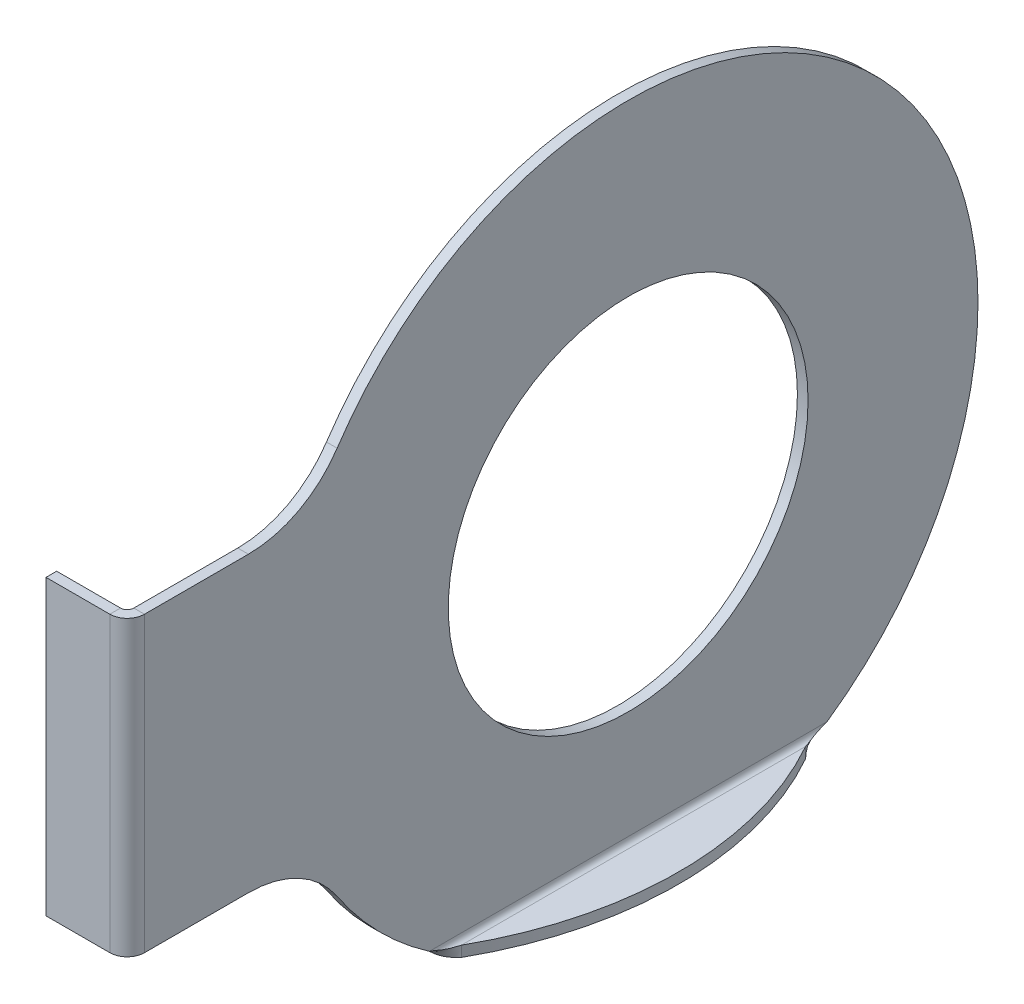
ISO-10303-21;
HEADER;
FILE_DESCRIPTION(('STEP AP214'),'2;1');
FILE_NAME('part.step','',(''),(''),'','','');
FILE_SCHEMA(('AUTOMOTIVE_DESIGN { 1 0 10303 214 1 1 1 1 }'));
ENDSEC;
DATA;
#1=APPLICATION_CONTEXT('core data for automotive mechanical design processes');
#2=APPLICATION_PROTOCOL_DEFINITION('international standard','automotive_design',2000,#1);
#3=PRODUCT_CONTEXT('',#1,'mechanical');
#4=PRODUCT('Part','Part','',(#3));
#5=PRODUCT_RELATED_PRODUCT_CATEGORY('part','',(#4));
#6=PRODUCT_DEFINITION_FORMATION('','',#4);
#7=PRODUCT_DEFINITION_CONTEXT('part definition',#1,'design');
#8=PRODUCT_DEFINITION('design','',#6,#7);
#9=PRODUCT_DEFINITION_SHAPE('','',#8);
#10=(LENGTH_UNIT() NAMED_UNIT(*) SI_UNIT(.MILLI.,.METRE.));
#11=(NAMED_UNIT(*) PLANE_ANGLE_UNIT() SI_UNIT($,.RADIAN.));
#12=(NAMED_UNIT(*) SI_UNIT($,.STERADIAN.) SOLID_ANGLE_UNIT());
#13=UNCERTAINTY_MEASURE_WITH_UNIT(LENGTH_MEASURE(1.E-05),#10,'distance_accuracy_value','');
#14=(GEOMETRIC_REPRESENTATION_CONTEXT(3) GLOBAL_UNCERTAINTY_ASSIGNED_CONTEXT((#13)) GLOBAL_UNIT_ASSIGNED_CONTEXT((#10,
#11,#12)) REPRESENTATION_CONTEXT('',''));
#15=CARTESIAN_POINT('',(0.,0.,0.));
#16=DIRECTION('',(0.,0.,1.));
#17=DIRECTION('',(1.,0.,0.));
#18=AXIS2_PLACEMENT_3D('',#15,#16,#17);
#19=CARTESIAN_POINT('',(0.,38.,56.9934206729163));
#20=DIRECTION('',(-1.,0.,0.));
#21=DIRECTION('',(0.,0.,1.));
#22=AXIS2_PLACEMENT_3D('',#19,#20,#21);
#23=PLANE('',#22);
#24=CARTESIAN_POINT('',(0.,0.,0.));
#25=DIRECTION('',(1.,0.,0.));
#26=DIRECTION('',(0.,0.,-1.));
#27=AXIS2_PLACEMENT_3D('',#24,#25,#26);
#28=CIRCLE('',#27,27.);
#29=CARTESIAN_POINT('',(0.,0.,-27.));
#30=VERTEX_POINT('',#29);
#31=EDGE_CURVE('E330',#30,#30,#28,.T.);
#32=ORIENTED_EDGE('',*,*,#31,.T.);
#33=EDGE_LOOP('',(#32));
#34=FACE_BOUND('',#33,.T.);
#35=DIRECTION('',(0.,0.,-1.));
#36=VECTOR('',#35,1.);
#37=CARTESIAN_POINT('',(0.,-22.,56.9934206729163));
#38=LINE('',#37,#36);
#39=CARTESIAN_POINT('',(0.,-22.,72.590498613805));
#40=VERTEX_POINT('',#39);
#41=CARTESIAN_POINT('',(0.,-22.,56.9934206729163));
#42=VERTEX_POINT('',#41);
#43=EDGE_CURVE('E80',#40,#42,#38,.T.);
#44=ORIENTED_EDGE('',*,*,#43,.F.);
#45=DIRECTION('',(0.,1.,0.));
#46=VECTOR('',#45,1.);
#47=CARTESIAN_POINT('',(0.,38.,72.590498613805));
#48=LINE('',#47,#46);
#49=CARTESIAN_POINT('',(0.,22.,72.590498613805));
#50=VERTEX_POINT('',#49);
#51=EDGE_CURVE('E72',#40,#50,#48,.T.);
#52=ORIENTED_EDGE('',*,*,#51,.T.);
#53=DIRECTION('',(0.,0.,1.));
#54=VECTOR('',#53,1.);
#55=CARTESIAN_POINT('',(0.,22.,56.9934206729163));
#56=LINE('',#55,#54);
#57=CARTESIAN_POINT('',(0.,22.,56.9934206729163));
#58=VERTEX_POINT('',#57);
#59=EDGE_CURVE('E88',#58,#50,#56,.T.);
#60=ORIENTED_EDGE('',*,*,#59,.F.);
#61=CARTESIAN_POINT('',(0.,38.,56.9934206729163));
#62=DIRECTION('',(-1.,0.,0.));
#63=DIRECTION('',(0.,0.,1.));
#64=AXIS2_PLACEMENT_3D('',#61,#62,#63);
#65=CIRCLE('',#64,16.);
#66=CARTESIAN_POINT('',(0.,29.1240875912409,43.6810888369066));
#67=VERTEX_POINT('',#66);
#68=EDGE_CURVE('E329',#67,#58,#65,.T.);
#69=ORIENTED_EDGE('',*,*,#68,.F.);
#70=CARTESIAN_POINT('',(0.,0.,0.));
#71=DIRECTION('',(1.,0.,0.));
#72=DIRECTION('',(0.,0.,-1.));
#73=AXIS2_PLACEMENT_3D('',#70,#71,#72);
#74=CIRCLE('',#73,52.5);
#75=CARTESIAN_POINT('',(0.,-43.1949484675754,-29.8403489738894));
#76=VERTEX_POINT('',#75);
#77=EDGE_CURVE('E345',#76,#67,#74,.T.);
#78=ORIENTED_EDGE('',*,*,#77,.F.);
#79=DIRECTION('',(0.,0.,1.));
#80=VECTOR('',#79,1.);
#81=CARTESIAN_POINT('',(0.,-43.1949484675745,56.9934206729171));
#82=LINE('',#81,#80);
#83=CARTESIAN_POINT('',(0.,-43.1949484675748,29.8403489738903));
#84=VERTEX_POINT('',#83);
#85=EDGE_CURVE('E400',#76,#84,#82,.T.);
#86=ORIENTED_EDGE('',*,*,#85,.T.);
#87=CARTESIAN_POINT('',(0.,-29.1240875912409,43.6810888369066));
#88=VERTEX_POINT('',#87);
#89=EDGE_CURVE('E337',#88,#84,#74,.T.);
#90=ORIENTED_EDGE('',*,*,#89,.F.);
#91=CARTESIAN_POINT('',(0.,-38.,56.9934206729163));
#92=DIRECTION('',(-1.,0.,0.));
#93=DIRECTION('',(0.,0.,-1.));
#94=AXIS2_PLACEMENT_3D('',#91,#92,#93);
#95=CIRCLE('',#94,16.);
#96=EDGE_CURVE('E343',#42,#88,#95,.T.);
#97=ORIENTED_EDGE('',*,*,#96,.F.);
#98=EDGE_LOOP('',(#44,#52,#60,#69,#78,#86,#90,#97));
#99=FACE_BOUND('',#98,.T.);
#100=ADVANCED_FACE('F63',(#34,#99),#23,.T.);
#101=CARTESIAN_POINT('',(1.6,0.,0.));
#102=DIRECTION('',(-1.,0.,0.));
#103=DIRECTION('',(0.,0.,1.));
#104=AXIS2_PLACEMENT_3D('',#101,#102,#103);
#105=CYLINDRICAL_SURFACE('',#104,52.5);
#106=CARTESIAN_POINT('',(1.6,-43.1949484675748,29.8403489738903));
#107=CARTESIAN_POINT('',(0.,-43.1949484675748,29.8403489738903));
#108=B_SPLINE_CURVE_WITH_KNOTS('',1,(#106,#107),.UNSPECIFIED.,.F.,.F.,(2,2),(0.,1.),.UNSPECIFIED.);
#109=CARTESIAN_POINT('',(1.6,-43.1949484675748,29.8403489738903));
#110=VERTEX_POINT('',#109);
#111=EDGE_CURVE('E317',#110,#84,#108,.T.);
#112=ORIENTED_EDGE('',*,*,#111,.F.);
#113=CARTESIAN_POINT('',(1.6,0.,0.));
#114=DIRECTION('',(1.,0.,0.));
#115=DIRECTION('',(0.,0.,-1.));
#116=AXIS2_PLACEMENT_3D('',#113,#114,#115);
#117=CIRCLE('',#116,52.5);
#118=CARTESIAN_POINT('',(1.6,-29.1240875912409,43.6810888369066));
#119=VERTEX_POINT('',#118);
#120=EDGE_CURVE('E350',#119,#110,#117,.T.);
#121=ORIENTED_EDGE('',*,*,#120,.F.);
#122=DIRECTION('',(-1.,0.,0.));
#123=VECTOR('',#122,1.);
#124=CARTESIAN_POINT('',(1.6,-29.1240875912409,43.6810888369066));
#125=LINE('',#124,#123);
#126=EDGE_CURVE('E349',#119,#88,#125,.T.);
#127=ORIENTED_EDGE('',*,*,#126,.T.);
#128=ORIENTED_EDGE('',*,*,#89,.T.);
#129=EDGE_LOOP('',(#112,#121,#127,#128));
#130=FACE_BOUND('',#129,.T.);
#131=ADVANCED_FACE('F388',(#130),#105,.T.);
#132=CARTESIAN_POINT('',(1.6,38.,56.9934206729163));
#133=DIRECTION('',(-1.,0.,0.));
#134=DIRECTION('',(0.,0.,1.));
#135=AXIS2_PLACEMENT_3D('',#132,#133,#134);
#136=PLANE('',#135);
#137=DIRECTION('',(0.,1.,0.));
#138=VECTOR('',#137,1.);
#139=CARTESIAN_POINT('',(1.6,38.,72.590498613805));
#140=LINE('',#139,#138);
#141=CARTESIAN_POINT('',(1.6,-22.,72.590498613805));
#142=VERTEX_POINT('',#141);
#143=CARTESIAN_POINT('',(1.6,22.,72.590498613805));
#144=VERTEX_POINT('',#143);
#145=EDGE_CURVE('E411',#142,#144,#140,.T.);
#146=ORIENTED_EDGE('',*,*,#145,.F.);
#147=DIRECTION('',(0.,0.,-1.));
#148=VECTOR('',#147,1.);
#149=CARTESIAN_POINT('',(1.6,-22.,56.9934206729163));
#150=LINE('',#149,#148);
#151=CARTESIAN_POINT('',(1.6,-22.,56.9934206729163));
#152=VERTEX_POINT('',#151);
#153=EDGE_CURVE('E67',#142,#152,#150,.T.);
#154=ORIENTED_EDGE('',*,*,#153,.T.);
#155=CARTESIAN_POINT('',(1.6,-38.,56.9934206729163));
#156=DIRECTION('',(-1.,0.,0.));
#157=DIRECTION('',(0.,0.,-1.));
#158=AXIS2_PLACEMENT_3D('',#155,#156,#157);
#159=CIRCLE('',#158,16.);
#160=EDGE_CURVE('E338',#152,#119,#159,.T.);
#161=ORIENTED_EDGE('',*,*,#160,.T.);
#162=ORIENTED_EDGE('',*,*,#120,.T.);
#163=DIRECTION('',(0.,0.,1.));
#164=VECTOR('',#163,1.);
#165=CARTESIAN_POINT('',(1.6,-43.1949484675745,56.9934206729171));
#166=LINE('',#165,#164);
#167=CARTESIAN_POINT('',(1.6,-43.1949484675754,-29.8403489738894));
#168=VERTEX_POINT('',#167);
#169=EDGE_CURVE('E358',#168,#110,#166,.T.);
#170=ORIENTED_EDGE('',*,*,#169,.F.);
#171=CARTESIAN_POINT('',(1.6,29.1240875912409,43.6810888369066));
#172=VERTEX_POINT('',#171);
#173=EDGE_CURVE('E340',#168,#172,#117,.T.);
#174=ORIENTED_EDGE('',*,*,#173,.T.);
#175=CARTESIAN_POINT('',(1.6,38.,56.9934206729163));
#176=DIRECTION('',(-1.,0.,0.));
#177=DIRECTION('',(0.,0.,1.));
#178=AXIS2_PLACEMENT_3D('',#175,#176,#177);
#179=CIRCLE('',#178,16.);
#180=CARTESIAN_POINT('',(1.6,22.,56.9934206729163));
#181=VERTEX_POINT('',#180);
#182=EDGE_CURVE('E333',#172,#181,#179,.T.);
#183=ORIENTED_EDGE('',*,*,#182,.T.);
#184=DIRECTION('',(0.,0.,1.));
#185=VECTOR('',#184,1.);
#186=CARTESIAN_POINT('',(1.6,22.,56.9934206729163));
#187=LINE('',#186,#185);
#188=EDGE_CURVE('E336',#181,#144,#187,.T.);
#189=ORIENTED_EDGE('',*,*,#188,.T.);
#190=EDGE_LOOP('',(#146,#154,#161,#162,#170,#174,#183,#189));
#191=FACE_BOUND('',#190,.T.);
#192=CARTESIAN_POINT('',(1.6,0.,0.));
#193=DIRECTION('',(1.,0.,0.));
#194=DIRECTION('',(0.,0.,-1.));
#195=AXIS2_PLACEMENT_3D('',#192,#193,#194);
#196=CIRCLE('',#195,27.);
#197=CARTESIAN_POINT('',(1.6,0.,-27.));
#198=VERTEX_POINT('',#197);
#199=EDGE_CURVE('E321',#198,#198,#196,.T.);
#200=ORIENTED_EDGE('',*,*,#199,.F.);
#201=EDGE_LOOP('',(#200));
#202=FACE_BOUND('',#201,.T.);
#203=ADVANCED_FACE('F390',(#191,#202),#136,.F.);
#204=CARTESIAN_POINT('',(1.6,38.,56.9934206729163));
#205=DIRECTION('',(-1.,0.,0.));
#206=DIRECTION('',(0.,0.,1.));
#207=AXIS2_PLACEMENT_3D('',#204,#205,#206);
#208=CYLINDRICAL_SURFACE('',#207,16.);
#209=ORIENTED_EDGE('',*,*,#68,.T.);
#210=DIRECTION('',(-1.,0.,0.));
#211=VECTOR('',#210,1.);
#212=CARTESIAN_POINT('',(1.6,22.,56.9934206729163));
#213=LINE('',#212,#211);
#214=EDGE_CURVE('E356',#181,#58,#213,.T.);
#215=ORIENTED_EDGE('',*,*,#214,.F.);
#216=ORIENTED_EDGE('',*,*,#182,.F.);
#217=DIRECTION('',(-1.,0.,0.));
#218=VECTOR('',#217,1.);
#219=CARTESIAN_POINT('',(1.6,29.1240875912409,43.6810888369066));
#220=LINE('',#219,#218);
#221=EDGE_CURVE('E346',#172,#67,#220,.T.);
#222=ORIENTED_EDGE('',*,*,#221,.T.);
#223=EDGE_LOOP('',(#209,#215,#216,#222));
#224=FACE_BOUND('',#223,.T.);
#225=ADVANCED_FACE('F389',(#224),#208,.F.);
#226=CARTESIAN_POINT('',(1.6,22.,56.9934206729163));
#227=DIRECTION('',(0.,-1.,0.));
#228=DIRECTION('',(0.,0.,-1.));
#229=AXIS2_PLACEMENT_3D('',#226,#227,#228);
#230=PLANE('',#229);
#231=DIRECTION('',(-1.,0.,0.));
#232=VECTOR('',#231,1.);
#233=CARTESIAN_POINT('',(1.6,22.,72.590498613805));
#234=LINE('',#233,#232);
#235=EDGE_CURVE('E431',#144,#50,#234,.T.);
#236=ORIENTED_EDGE('',*,*,#235,.F.);
#237=ORIENTED_EDGE('',*,*,#188,.F.);
#238=ORIENTED_EDGE('',*,*,#214,.T.);
#239=ORIENTED_EDGE('',*,*,#59,.T.);
#240=EDGE_LOOP('',(#236,#237,#238,#239));
#241=FACE_BOUND('',#240,.T.);
#242=ADVANCED_FACE('F543',(#241),#230,.F.);
#243=CARTESIAN_POINT('',(1.6,-22.,56.9934206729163));
#244=DIRECTION('',(0.,1.,0.));
#245=DIRECTION('',(0.,0.,1.));
#246=AXIS2_PLACEMENT_3D('',#243,#244,#245);
#247=PLANE('',#246);
#248=DIRECTION('',(1.,0.,0.));
#249=VECTOR('',#248,1.);
#250=CARTESIAN_POINT('',(1.6,-22.,72.590498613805));
#251=LINE('',#250,#249);
#252=EDGE_CURVE('E12',#40,#142,#251,.T.);
#253=ORIENTED_EDGE('',*,*,#252,.F.);
#254=ORIENTED_EDGE('',*,*,#43,.T.);
#255=DIRECTION('',(-1.,0.,0.));
#256=VECTOR('',#255,1.);
#257=CARTESIAN_POINT('',(1.6,-22.,56.9934206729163));
#258=LINE('',#257,#256);
#259=EDGE_CURVE('E353',#152,#42,#258,.T.);
#260=ORIENTED_EDGE('',*,*,#259,.F.);
#261=ORIENTED_EDGE('',*,*,#153,.F.);
#262=EDGE_LOOP('',(#253,#254,#260,#261));
#263=FACE_BOUND('',#262,.T.);
#264=ADVANCED_FACE('F65',(#263),#247,.F.);
#265=CARTESIAN_POINT('',(1.6,-38.,56.9934206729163));
#266=DIRECTION('',(-1.,0.,0.));
#267=DIRECTION('',(0.,0.,1.));
#268=AXIS2_PLACEMENT_3D('',#265,#266,#267);
#269=CYLINDRICAL_SURFACE('',#268,16.);
#270=ORIENTED_EDGE('',*,*,#96,.T.);
#271=ORIENTED_EDGE('',*,*,#126,.F.);
#272=ORIENTED_EDGE('',*,*,#160,.F.);
#273=ORIENTED_EDGE('',*,*,#259,.T.);
#274=EDGE_LOOP('',(#270,#271,#272,#273));
#275=FACE_BOUND('',#274,.T.);
#276=ADVANCED_FACE('F386',(#275),#269,.F.);
#277=CARTESIAN_POINT('',(0.,-43.1949484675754,-29.8403489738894));
#278=CARTESIAN_POINT('',(1.6,-43.1949484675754,-29.8403489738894));
#279=B_SPLINE_CURVE_WITH_KNOTS('',1,(#277,#278),.UNSPECIFIED.,.F.,.F.,(2,2),(0.,1.),.UNSPECIFIED.);
#280=EDGE_CURVE('E407',#76,#168,#279,.T.);
#281=ORIENTED_EDGE('',*,*,#280,.F.);
#282=ORIENTED_EDGE('',*,*,#77,.T.);
#283=ORIENTED_EDGE('',*,*,#221,.F.);
#284=ORIENTED_EDGE('',*,*,#173,.F.);
#285=EDGE_LOOP('',(#281,#282,#283,#284));
#286=FACE_BOUND('',#285,.T.);
#287=ADVANCED_FACE('F376',(#286),#105,.T.);
#288=CARTESIAN_POINT('',(1.6,0.,0.));
#289=DIRECTION('',(-1.,0.,0.));
#290=DIRECTION('',(0.,0.,1.));
#291=AXIS2_PLACEMENT_3D('',#288,#289,#290);
#292=CYLINDRICAL_SURFACE('',#291,27.);
#293=ORIENTED_EDGE('',*,*,#199,.T.);
#294=EDGE_LOOP('',(#293));
#295=FACE_BOUND('',#294,.T.);
#296=ORIENTED_EDGE('',*,*,#31,.F.);
#297=EDGE_LOOP('',(#296));
#298=FACE_BOUND('',#297,.T.);
#299=ADVANCED_FACE('F291',(#295,#298),#292,.F.);
#300=CARTESIAN_POINT('',(2.39999999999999,-45.5949484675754,-25.8265055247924));
#301=CARTESIAN_POINT('',(2.31389925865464,-45.5949484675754,-25.9228106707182));
#302=CARTESIAN_POINT('',(2.18715231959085,-45.5912566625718,-26.0554432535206));
#303=CARTESIAN_POINT('',(1.94105876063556,-45.5521230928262,-26.308413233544));
#304=CARTESIAN_POINT('',(1.84976271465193,-45.5332934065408,-26.401766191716));
#305=CARTESIAN_POINT('',(1.7009628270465,-45.4914679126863,-26.5553400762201));
#306=CARTESIAN_POINT('',(1.64940090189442,-45.4752544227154,-26.6087887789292));
#307=CARTESIAN_POINT('',(1.56952098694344,-45.4468594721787,-26.6923479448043));
#308=CARTESIAN_POINT('',(1.54247269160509,-45.4367150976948,-26.7207653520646));
#309=CARTESIAN_POINT('',(1.50132989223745,-45.420394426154,-26.764237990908));
#310=CARTESIAN_POINT('',(1.48752064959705,-45.4147701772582,-26.7788699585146));
#311=CARTESIAN_POINT('',(1.46667285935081,-45.4060471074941,-26.8010295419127));
#312=CARTESIAN_POINT('',(1.45970128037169,-45.4030916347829,-26.8084513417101));
#313=CARTESIAN_POINT('',(1.44921155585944,-45.3985854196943,-26.8196369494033));
#314=CARTESIAN_POINT('',(1.44570958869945,-45.3970711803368,-26.8233743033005));
#315=CARTESIAN_POINT('',(1.43869506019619,-45.3940181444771,-26.830866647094));
#316=CARTESIAN_POINT('',(1.43445526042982,-45.3921586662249,-26.8353997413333));
#317=CARTESIAN_POINT('',(1.2530712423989,-45.3121758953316,-27.0294704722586));
#318=CARTESIAN_POINT('',(1.09895360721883,-45.2183068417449,-27.2090553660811));
#319=CARTESIAN_POINT('',(0.902271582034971,-45.0720432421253,-27.4611825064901));
#320=CARTESIAN_POINT('',(0.842399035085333,-45.0223288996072,-27.5423498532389));
#321=CARTESIAN_POINT('',(0.760444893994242,-44.9480083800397,-27.659788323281));
#322=CARTESIAN_POINT('',(0.734433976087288,-44.9232734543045,-27.6982157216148));
#323=CARTESIAN_POINT('',(0.697279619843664,-44.8864116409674,-27.7547786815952));
#324=CARTESIAN_POINT('',(0.685205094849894,-44.8741642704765,-27.7734533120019));
#325=CARTESIAN_POINT('',(0.667545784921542,-44.8558741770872,-27.801195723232));
#326=CARTESIAN_POINT('',(0.661734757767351,-44.849790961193,-27.8103982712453));
#327=CARTESIAN_POINT('',(0.653129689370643,-44.8406888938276,-27.8241347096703));
#328=CARTESIAN_POINT('',(0.65027991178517,-44.8376586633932,-27.8287022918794));
#329=CARTESIAN_POINT('',(0.646032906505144,-44.8331193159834,-27.8355368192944));
#330=CARTESIAN_POINT('',(0.644621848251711,-44.8316071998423,-27.8378121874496));
#331=CARTESIAN_POINT('',(0.641808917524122,-44.8285850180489,-27.8423573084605));
#332=CARTESIAN_POINT('',(0.639611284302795,-44.8262155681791,-27.8459180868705));
#333=CARTESIAN_POINT('',(0.600511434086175,-44.7839895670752,-27.9093528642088));
#334=CARTESIAN_POINT('',(0.532505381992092,-44.7093375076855,-28.0240627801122));
#335=CARTESIAN_POINT('',(0.406266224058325,-44.53295190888,-28.2745042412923));
#336=CARTESIAN_POINT('',(0.360354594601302,-44.4633083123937,-28.3710474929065));
#337=CARTESIAN_POINT('',(0.290440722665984,-44.3403663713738,-28.5354565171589));
#338=CARTESIAN_POINT('',(0.266978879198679,-44.2963075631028,-28.5935252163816));
#339=CARTESIAN_POINT('',(0.232300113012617,-44.225370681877,-28.6855268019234));
#340=CARTESIAN_POINT('',(0.22082735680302,-44.2009174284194,-28.7170104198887));
#341=CARTESIAN_POINT('',(0.203852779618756,-44.163002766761,-28.7654604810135));
#342=CARTESIAN_POINT('',(0.198233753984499,-44.1501587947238,-28.7818146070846));
#343=CARTESIAN_POINT('',(0.189877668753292,-44.1305817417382,-28.8066519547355));
#344=CARTESIAN_POINT('',(0.187104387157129,-44.1240042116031,-28.8149820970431));
#345=CARTESIAN_POINT('',(0.18296433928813,-44.114059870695,-28.8275538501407));
#346=CARTESIAN_POINT('',(0.181587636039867,-44.1107320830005,-28.8317571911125));
#347=CARTESIAN_POINT('',(0.178841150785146,-44.1040504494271,-28.8401893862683));
#348=CARTESIAN_POINT('',(0.177076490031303,-44.0997234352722,-28.8456442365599));
#349=CARTESIAN_POINT('',(0.0517796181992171,-43.7909325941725,-29.2346585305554));
#350=CARTESIAN_POINT('',(0.,-43.4807363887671,-29.5655098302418));
#351=CARTESIAN_POINT('',(0.,-43.1949484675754,-29.8403489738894));
#352=CARTESIAN_POINT('',(2.4,-43.9949484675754,-25.8265055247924));
#353=CARTESIAN_POINT('',(2.37127433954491,-43.9949484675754,-25.9228959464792));
#354=CARTESIAN_POINT('',(2.32905077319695,-43.9937178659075,-26.0554432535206));
#355=CARTESIAN_POINT('',(2.24701958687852,-43.980673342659,-26.308413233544));
#356=CARTESIAN_POINT('',(2.21658757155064,-43.9743967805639,-26.401766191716));
#357=CARTESIAN_POINT('',(2.1669876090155,-43.960454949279,-26.5553400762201));
#358=CARTESIAN_POINT('',(2.14980030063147,-43.9550504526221,-26.6087887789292));
#359=CARTESIAN_POINT('',(2.12317366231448,-43.9455854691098,-26.6923479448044));
#360=CARTESIAN_POINT('',(2.11415756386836,-43.9422040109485,-26.7207653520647));
#361=CARTESIAN_POINT('',(2.10044329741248,-43.9367637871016,-26.764237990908));
#362=CARTESIAN_POINT('',(2.09584021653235,-43.9348890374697,-26.7788699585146));
#363=CARTESIAN_POINT('',(2.08889095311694,-43.9319813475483,-26.8010295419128));
#364=CARTESIAN_POINT('',(2.08656709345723,-43.9309961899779,-26.8084513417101));
#365=CARTESIAN_POINT('',(2.08307051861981,-43.9294941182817,-26.8196369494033));
#366=CARTESIAN_POINT('',(2.08190319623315,-43.9289893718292,-26.8233743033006));
#367=CARTESIAN_POINT('',(2.0795650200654,-43.9279716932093,-26.830866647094));
#368=CARTESIAN_POINT('',(2.07815175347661,-43.9273518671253,-26.8353997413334));
#369=CARTESIAN_POINT('',(2.01769041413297,-43.9006909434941,-27.0294704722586));
#370=CARTESIAN_POINT('',(1.96631786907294,-43.8694012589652,-27.2090553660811));
#371=CARTESIAN_POINT('',(1.90075719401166,-43.8206467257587,-27.4611825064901));
#372=CARTESIAN_POINT('',(1.88079967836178,-43.8040752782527,-27.5423498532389));
#373=CARTESIAN_POINT('',(1.85348163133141,-43.7793017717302,-27.659788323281));
#374=CARTESIAN_POINT('',(1.84481132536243,-43.7710567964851,-27.6982157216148));
#375=CARTESIAN_POINT('',(1.83242653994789,-43.7587695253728,-27.7547786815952));
#376=CARTESIAN_POINT('',(1.8284016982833,-43.7546870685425,-27.7734533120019));
#377=CARTESIAN_POINT('',(1.82251526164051,-43.748590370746,-27.801195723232));
#378=CARTESIAN_POINT('',(1.82057825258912,-43.7465626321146,-27.8103982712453));
#379=CARTESIAN_POINT('',(1.81770989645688,-43.7435286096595,-27.8241347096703));
#380=CARTESIAN_POINT('',(1.81675997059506,-43.742518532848,-27.8287022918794));
#381=CARTESIAN_POINT('',(1.81534430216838,-43.7410054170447,-27.8355368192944));
#382=CARTESIAN_POINT('',(1.81487394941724,-43.740501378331,-27.8378121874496));
#383=CARTESIAN_POINT('',(1.81393630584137,-43.7394939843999,-27.8423573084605));
#384=CARTESIAN_POINT('',(1.81320376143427,-43.7387041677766,-27.8459180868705));
#385=CARTESIAN_POINT('',(1.80017047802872,-43.7246288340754,-27.9093528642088));
#386=CARTESIAN_POINT('',(1.77750179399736,-43.6997448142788,-28.0240627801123));
#387=CARTESIAN_POINT('',(1.73542207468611,-43.640949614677,-28.2745042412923));
#388=CARTESIAN_POINT('',(1.72011819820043,-43.6177350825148,-28.3710474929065));
#389=CARTESIAN_POINT('',(1.696813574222,-43.5767544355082,-28.5354565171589));
#390=CARTESIAN_POINT('',(1.68899295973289,-43.5620681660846,-28.5935252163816));
#391=CARTESIAN_POINT('',(1.67743337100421,-43.5384225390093,-28.6855268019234));
#392=CARTESIAN_POINT('',(1.67360911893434,-43.5302714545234,-28.7170104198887));
#393=CARTESIAN_POINT('',(1.66795092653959,-43.5176332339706,-28.7654604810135));
#394=CARTESIAN_POINT('',(1.66607791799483,-43.5133519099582,-28.7818146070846));
#395=CARTESIAN_POINT('',(1.6632925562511,-43.5068262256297,-28.8066519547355));
#396=CARTESIAN_POINT('',(1.66236812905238,-43.5046337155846,-28.8149820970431));
#397=CARTESIAN_POINT('',(1.66098811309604,-43.5013189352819,-28.8275538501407));
#398=CARTESIAN_POINT('',(1.66052921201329,-43.5002096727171,-28.8317571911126));
#399=CARTESIAN_POINT('',(1.65961371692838,-43.497982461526,-28.8401893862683));
#400=CARTESIAN_POINT('',(1.6590254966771,-43.4965401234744,-28.8456442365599));
#401=CARTESIAN_POINT('',(1.61725987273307,-43.3936098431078,-29.2346585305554));
#402=CARTESIAN_POINT('',(1.6,-43.2902903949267,-29.565281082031));
#403=CARTESIAN_POINT('',(1.6,-43.1949484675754,-29.8403489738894));
#404=B_SPLINE_SURFACE_WITH_KNOTS('',1,3,((#300,#301,#302,#303,#304,#305,#306,#307,#308,#309,
#310,#311,#312,#313,#314,#315,#316,#317,#318,#319,#320,#321,#322,#323,#324,#325,#326,#327,#328,
#329,#330,#331,#332,#333,#334,#335,#336,#337,#338,#339,#340,#341,#342,#343,#344,#345,#346,#347,
#348,#349,#350,#351),(#352,#353,#354,#355,#356,#357,#358,#359,#360,#361,#362,#363,#364,#365,
#366,#367,#368,#369,#370,#371,#372,#373,#374,#375,#376,#377,#378,#379,#380,#381,#382,#383,#384,
#385,#386,#387,#388,#389,#390,#391,#392,#393,#394,#395,#396,#397,#398,#399,#400,#401,#402,
#403)),.UNSPECIFIED.,.F.,.F.,.F.,(2,2),(4,2,2,2,2,2,2,2,2,2,2,2,2,2,2,2,2,2,2,2,2,2,2,2,2,4),
(0.,1.),(0.,0.125,0.1875,0.21875,0.234375,0.2421875,0.24609375,0.248046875,0.25,0.375,0.4375,
0.46875,0.484375,0.4921875,0.49609375,0.498046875,0.5,0.625,0.6875,0.71875,0.734375,0.7421875,
0.74609375,0.748046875,0.75,1.),.UNSPECIFIED.);
#405=CARTESIAN_POINT('',(2.4,-43.9949484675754,-25.8265055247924));
#406=CARTESIAN_POINT('',(2.39999999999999,-45.5949484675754,-25.8265055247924));
#407=B_SPLINE_CURVE_WITH_KNOTS('',1,(#405,#406),.UNSPECIFIED.,.F.,.F.,(2,2),(0.,1.),.UNSPECIFIED.);
#408=CARTESIAN_POINT('',(2.40000000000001,-45.5949484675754,-25.8265055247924));
#409=VERTEX_POINT('',#408);
#410=CARTESIAN_POINT('',(2.4,-43.9949484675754,-25.8265055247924));
#411=VERTEX_POINT('',#410);
#412=EDGE_CURVE('E498',#409,#411,#407,.F.);
#413=CARTESIAN_POINT('',(2.39999999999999,-45.5949484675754,-25.8265055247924));
#414=CARTESIAN_POINT('',(2.31389925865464,-45.5949484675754,-25.9228106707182));
#415=CARTESIAN_POINT('',(2.18715231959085,-45.5912566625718,-26.0554432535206));
#416=CARTESIAN_POINT('',(1.94105876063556,-45.5521230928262,-26.308413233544));
#417=CARTESIAN_POINT('',(1.84976271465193,-45.5332934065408,-26.401766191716));
#418=CARTESIAN_POINT('',(1.7009628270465,-45.4914679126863,-26.5553400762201));
#419=CARTESIAN_POINT('',(1.64940090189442,-45.4752544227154,-26.6087887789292));
#420=CARTESIAN_POINT('',(1.56952098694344,-45.4468594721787,-26.6923479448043));
#421=CARTESIAN_POINT('',(1.54247269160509,-45.4367150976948,-26.7207653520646));
#422=CARTESIAN_POINT('',(1.50132989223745,-45.420394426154,-26.764237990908));
#423=CARTESIAN_POINT('',(1.48752064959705,-45.4147701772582,-26.7788699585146));
#424=CARTESIAN_POINT('',(1.46667285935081,-45.4060471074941,-26.8010295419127));
#425=CARTESIAN_POINT('',(1.45970128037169,-45.4030916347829,-26.8084513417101));
#426=CARTESIAN_POINT('',(1.44921155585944,-45.3985854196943,-26.8196369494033));
#427=CARTESIAN_POINT('',(1.44570958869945,-45.3970711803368,-26.8233743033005));
#428=CARTESIAN_POINT('',(1.43869506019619,-45.3940181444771,-26.830866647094));
#429=CARTESIAN_POINT('',(1.43445526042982,-45.3921586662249,-26.8353997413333));
#430=CARTESIAN_POINT('',(1.2530712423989,-45.3121758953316,-27.0294704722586));
#431=CARTESIAN_POINT('',(1.09895360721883,-45.2183068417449,-27.2090553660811));
#432=CARTESIAN_POINT('',(0.902271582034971,-45.0720432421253,-27.4611825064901));
#433=CARTESIAN_POINT('',(0.842399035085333,-45.0223288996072,-27.5423498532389));
#434=CARTESIAN_POINT('',(0.760444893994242,-44.9480083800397,-27.659788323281));
#435=CARTESIAN_POINT('',(0.734433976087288,-44.9232734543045,-27.6982157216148));
#436=CARTESIAN_POINT('',(0.697279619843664,-44.8864116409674,-27.7547786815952));
#437=CARTESIAN_POINT('',(0.685205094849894,-44.8741642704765,-27.7734533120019));
#438=CARTESIAN_POINT('',(0.667545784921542,-44.8558741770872,-27.801195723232));
#439=CARTESIAN_POINT('',(0.661734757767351,-44.849790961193,-27.8103982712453));
#440=CARTESIAN_POINT('',(0.653129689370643,-44.8406888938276,-27.8241347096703));
#441=CARTESIAN_POINT('',(0.65027991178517,-44.8376586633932,-27.8287022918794));
#442=CARTESIAN_POINT('',(0.646032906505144,-44.8331193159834,-27.8355368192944));
#443=CARTESIAN_POINT('',(0.644621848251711,-44.8316071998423,-27.8378121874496));
#444=CARTESIAN_POINT('',(0.641808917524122,-44.8285850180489,-27.8423573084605));
#445=CARTESIAN_POINT('',(0.639611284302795,-44.8262155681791,-27.8459180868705));
#446=CARTESIAN_POINT('',(0.600511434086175,-44.7839895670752,-27.9093528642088));
#447=CARTESIAN_POINT('',(0.532505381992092,-44.7093375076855,-28.0240627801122));
#448=CARTESIAN_POINT('',(0.406266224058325,-44.53295190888,-28.2745042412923));
#449=CARTESIAN_POINT('',(0.360354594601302,-44.4633083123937,-28.3710474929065));
#450=CARTESIAN_POINT('',(0.290440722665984,-44.3403663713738,-28.5354565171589));
#451=CARTESIAN_POINT('',(0.266978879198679,-44.2963075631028,-28.5935252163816));
#452=CARTESIAN_POINT('',(0.232300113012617,-44.225370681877,-28.6855268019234));
#453=CARTESIAN_POINT('',(0.22082735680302,-44.2009174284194,-28.7170104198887));
#454=CARTESIAN_POINT('',(0.203852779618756,-44.163002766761,-28.7654604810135));
#455=CARTESIAN_POINT('',(0.198233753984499,-44.1501587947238,-28.7818146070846));
#456=CARTESIAN_POINT('',(0.189877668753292,-44.1305817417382,-28.8066519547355));
#457=CARTESIAN_POINT('',(0.187104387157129,-44.1240042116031,-28.8149820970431));
#458=CARTESIAN_POINT('',(0.18296433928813,-44.114059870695,-28.8275538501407));
#459=CARTESIAN_POINT('',(0.181587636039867,-44.1107320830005,-28.8317571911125));
#460=CARTESIAN_POINT('',(0.178841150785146,-44.1040504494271,-28.8401893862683));
#461=CARTESIAN_POINT('',(0.177076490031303,-44.0997234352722,-28.8456442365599));
#462=CARTESIAN_POINT('',(0.0517796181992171,-43.7909325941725,-29.2346585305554));
#463=CARTESIAN_POINT('',(0.,-43.4807363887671,-29.5655098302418));
#464=CARTESIAN_POINT('',(0.,-43.1949484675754,-29.8403489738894));
#465=B_SPLINE_CURVE_WITH_KNOTS('',3,(#413,#414,#415,#416,#417,#418,#419,#420,#421,#422,#423,
#424,#425,#426,#427,#428,#429,#430,#431,#432,#433,#434,#435,#436,#437,#438,#439,#440,#441,#442,
#443,#444,#445,#446,#447,#448,#449,#450,#451,#452,#453,#454,#455,#456,#457,#458,#459,#460,#461,
#462,#463,#464),.UNSPECIFIED.,.F.,.F.,(4,2,2,2,2,2,2,2,2,2,2,2,2,2,2,2,2,2,2,2,2,2,2,2,2,4),(0.,
0.125,0.1875,0.21875,0.234375,0.2421875,0.24609375,0.248046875,0.25,0.375,0.4375,0.46875,
0.484375,0.4921875,0.49609375,0.498046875,0.5,0.625,0.6875,0.71875,0.734375,0.7421875,
0.74609375,0.748046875,0.75,1.),.UNSPECIFIED.);
#466=EDGE_CURVE('E502',#409,#76,#465,.T.);
#467=CARTESIAN_POINT('',(1.6,-43.1949484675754,-29.8403489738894));
#468=CARTESIAN_POINT('',(1.6,-43.2902903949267,-29.565281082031));
#469=CARTESIAN_POINT('',(1.61725987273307,-43.3936098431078,-29.2346585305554));
#470=CARTESIAN_POINT('',(1.6590254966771,-43.4965401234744,-28.8456442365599));
#471=CARTESIAN_POINT('',(1.65961371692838,-43.497982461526,-28.8401893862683));
#472=CARTESIAN_POINT('',(1.66052921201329,-43.5002096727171,-28.8317571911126));
#473=CARTESIAN_POINT('',(1.66098811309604,-43.5013189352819,-28.8275538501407));
#474=CARTESIAN_POINT('',(1.66236812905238,-43.5046337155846,-28.8149820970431));
#475=CARTESIAN_POINT('',(1.6632925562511,-43.5068262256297,-28.8066519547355));
#476=CARTESIAN_POINT('',(1.66607791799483,-43.5133519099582,-28.7818146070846));
#477=CARTESIAN_POINT('',(1.66795092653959,-43.5176332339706,-28.7654604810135));
#478=CARTESIAN_POINT('',(1.67360911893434,-43.5302714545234,-28.7170104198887));
#479=CARTESIAN_POINT('',(1.67743337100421,-43.5384225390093,-28.6855268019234));
#480=CARTESIAN_POINT('',(1.68899295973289,-43.5620681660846,-28.5935252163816));
#481=CARTESIAN_POINT('',(1.696813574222,-43.5767544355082,-28.5354565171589));
#482=CARTESIAN_POINT('',(1.72011819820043,-43.6177350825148,-28.3710474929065));
#483=CARTESIAN_POINT('',(1.73542207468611,-43.640949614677,-28.2745042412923));
#484=CARTESIAN_POINT('',(1.77750179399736,-43.6997448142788,-28.0240627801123));
#485=CARTESIAN_POINT('',(1.80017047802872,-43.7246288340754,-27.9093528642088));
#486=CARTESIAN_POINT('',(1.81320376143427,-43.7387041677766,-27.8459180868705));
#487=CARTESIAN_POINT('',(1.81393630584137,-43.7394939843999,-27.8423573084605));
#488=CARTESIAN_POINT('',(1.81487394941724,-43.740501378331,-27.8378121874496));
#489=CARTESIAN_POINT('',(1.81534430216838,-43.7410054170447,-27.8355368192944));
#490=CARTESIAN_POINT('',(1.81675997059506,-43.742518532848,-27.8287022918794));
#491=CARTESIAN_POINT('',(1.81770989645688,-43.7435286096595,-27.8241347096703));
#492=CARTESIAN_POINT('',(1.82057825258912,-43.7465626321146,-27.8103982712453));
#493=CARTESIAN_POINT('',(1.82251526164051,-43.748590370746,-27.801195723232));
#494=CARTESIAN_POINT('',(1.8284016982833,-43.7546870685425,-27.7734533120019));
#495=CARTESIAN_POINT('',(1.83242653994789,-43.7587695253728,-27.7547786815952));
#496=CARTESIAN_POINT('',(1.84481132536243,-43.7710567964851,-27.6982157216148));
#497=CARTESIAN_POINT('',(1.85348163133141,-43.7793017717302,-27.659788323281));
#498=CARTESIAN_POINT('',(1.88079967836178,-43.8040752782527,-27.5423498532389));
#499=CARTESIAN_POINT('',(1.90075719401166,-43.8206467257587,-27.4611825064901));
#500=CARTESIAN_POINT('',(1.96631786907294,-43.8694012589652,-27.2090553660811));
#501=CARTESIAN_POINT('',(2.01769041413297,-43.9006909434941,-27.0294704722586));
#502=CARTESIAN_POINT('',(2.07815175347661,-43.9273518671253,-26.8353997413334));
#503=CARTESIAN_POINT('',(2.0795650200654,-43.9279716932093,-26.830866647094));
#504=CARTESIAN_POINT('',(2.08190319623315,-43.9289893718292,-26.8233743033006));
#505=CARTESIAN_POINT('',(2.08307051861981,-43.9294941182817,-26.8196369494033));
#506=CARTESIAN_POINT('',(2.08656709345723,-43.9309961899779,-26.8084513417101));
#507=CARTESIAN_POINT('',(2.08889095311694,-43.9319813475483,-26.8010295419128));
#508=CARTESIAN_POINT('',(2.09584021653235,-43.9348890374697,-26.7788699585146));
#509=CARTESIAN_POINT('',(2.10044329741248,-43.9367637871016,-26.764237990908));
#510=CARTESIAN_POINT('',(2.11415756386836,-43.9422040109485,-26.7207653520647));
#511=CARTESIAN_POINT('',(2.12317366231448,-43.9455854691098,-26.6923479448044));
#512=CARTESIAN_POINT('',(2.14980030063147,-43.9550504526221,-26.6087887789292));
#513=CARTESIAN_POINT('',(2.1669876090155,-43.960454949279,-26.5553400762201));
#514=CARTESIAN_POINT('',(2.21658757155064,-43.9743967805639,-26.401766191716));
#515=CARTESIAN_POINT('',(2.24701958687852,-43.980673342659,-26.308413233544));
#516=CARTESIAN_POINT('',(2.32905077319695,-43.9937178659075,-26.0554432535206));
#517=CARTESIAN_POINT('',(2.37127433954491,-43.9949484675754,-25.9228959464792));
#518=CARTESIAN_POINT('',(2.4,-43.9949484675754,-25.8265055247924));
#519=B_SPLINE_CURVE_WITH_KNOTS('',3,(#467,#468,#469,#470,#471,#472,#473,#474,#475,#476,#477,
#478,#479,#480,#481,#482,#483,#484,#485,#486,#487,#488,#489,#490,#491,#492,#493,#494,#495,#496,
#497,#498,#499,#500,#501,#502,#503,#504,#505,#506,#507,#508,#509,#510,#511,#512,#513,#514,#515,
#516,#517,#518),.UNSPECIFIED.,.F.,.F.,(4,2,2,2,2,2,2,2,2,2,2,2,2,2,2,2,2,2,2,2,2,2,2,2,2,4),(0.,
0.25,0.251953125,0.25390625,0.2578125,0.265625,0.28125,0.3125,0.375,0.5,0.501953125,0.50390625,
0.5078125,0.515625,0.53125,0.5625,0.625,0.75,0.751953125,0.75390625,0.7578125,0.765625,0.78125,
0.8125,0.875,1.),.UNSPECIFIED.);
#520=EDGE_CURVE('E512',#411,#168,#519,.F.);
#521=ORIENTED_EDGE('',*,*,#412,.F.);
#522=ORIENTED_EDGE('',*,*,#466,.T.);
#523=ORIENTED_EDGE('',*,*,#280,.T.);
#524=ORIENTED_EDGE('',*,*,#520,.F.);
#525=EDGE_LOOP('',(#521,#522,#523,#524));
#526=FACE_BOUND('',#525,.T.);
#527=ADVANCED_FACE('F287',(#526),#404,.F.);
#528=CARTESIAN_POINT('',(0.,-43.1949484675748,29.8403489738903));
#529=CARTESIAN_POINT('',(0.,-43.2991144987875,29.7255000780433));
#530=CARTESIAN_POINT('',(0.00611234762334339,-43.4384365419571,29.5843069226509));
#531=CARTESIAN_POINT('',(0.0509232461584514,-43.6942825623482,29.3334782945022));
#532=CARTESIAN_POINT('',(0.0719345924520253,-43.7873055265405,29.2433357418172));
#533=CARTESIAN_POINT('',(0.116814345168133,-43.9364045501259,29.0983223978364));
#534=CARTESIAN_POINT('',(0.134006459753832,-43.9876859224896,29.0483513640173));
#535=CARTESIAN_POINT('',(0.163703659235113,-44.0665954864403,28.9709449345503));
#536=CARTESIAN_POINT('',(0.174254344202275,-44.0932289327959,28.9447344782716));
#537=CARTESIAN_POINT('',(0.191128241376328,-44.1336169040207,28.904806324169));
#538=CARTESIAN_POINT('',(0.196927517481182,-44.14715245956,28.8913948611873));
#539=CARTESIAN_POINT('',(0.208887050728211,-44.1743589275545,28.8643677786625));
#540=CARTESIAN_POINT('',(0.215404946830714,-44.1888037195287,28.8499791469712));
#541=CARTESIAN_POINT('',(0.317216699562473,-44.4091101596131,28.6299194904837));
#542=CARTESIAN_POINT('',(0.430734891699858,-44.5779270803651,28.4427475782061));
#543=CARTESIAN_POINT('',(0.596849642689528,-44.781235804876,28.191904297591));
#544=CARTESIAN_POINT('',(0.651664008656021,-44.8407983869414,28.1132756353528));
#545=CARTESIAN_POINT('',(0.730385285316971,-44.9194083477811,28.0028112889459));
#546=CARTESIAN_POINT('',(0.756050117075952,-44.9438245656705,27.967236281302));
#547=CARTESIAN_POINT('',(0.793416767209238,-44.9779725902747,27.9157434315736));
#548=CARTESIAN_POINT('',(0.805684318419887,-44.9889425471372,27.8988907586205));
#549=CARTESIAN_POINT('',(0.823774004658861,-45.0048036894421,27.8740791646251));
#550=CARTESIAN_POINT('',(0.829751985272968,-45.0099917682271,27.8658865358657));
#551=CARTESIAN_POINT('',(0.841599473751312,-45.0201741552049,27.8496570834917));
#552=CARTESIAN_POINT('',(0.846921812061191,-45.024707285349,27.8423694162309));
#553=CARTESIAN_POINT('',(0.95504548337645,-45.1158385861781,27.6943321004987));
#554=CARTESIAN_POINT('',(1.06841762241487,-45.1968967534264,27.5410432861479));
#555=CARTESIAN_POINT('',(1.25591092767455,-45.3059404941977,27.2901707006));
#556=CARTESIAN_POINT('',(1.32130070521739,-45.3401895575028,27.2030566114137));
#557=CARTESIAN_POINT('',(1.42358271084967,-45.3876687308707,27.0671506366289));
#558=CARTESIAN_POINT('',(1.4583751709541,-45.4028456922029,27.020976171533));
#559=CARTESIAN_POINT('',(1.51158350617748,-45.4245410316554,26.9504057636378));
#560=CARTESIAN_POINT('',(1.52948948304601,-45.4315944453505,26.9266641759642));
#561=CARTESIAN_POINT('',(1.55659904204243,-45.4418949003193,26.890724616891));
#562=CARTESIAN_POINT('',(1.56567732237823,-45.4452817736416,26.8786902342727));
#563=CARTESIAN_POINT('',(1.57935681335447,-45.4502906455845,26.8605568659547));
#564=CARTESIAN_POINT('',(1.58392698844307,-45.4519483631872,26.8544987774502));
#565=CARTESIAN_POINT('',(1.59079769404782,-45.4544168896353,26.8453911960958));
#566=CARTESIAN_POINT('',(1.59309050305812,-45.4552367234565,26.8423519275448));
#567=CARTESIAN_POINT('',(1.59768125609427,-45.4568703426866,26.8362665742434));
#568=CARTESIAN_POINT('',(1.59908358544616,-45.4573684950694,26.8344076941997));
#569=CARTESIAN_POINT('',(1.80683137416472,-45.530583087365,26.5590223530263));
#570=CARTESIAN_POINT('',(1.98151684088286,-45.5620650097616,26.339809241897));
#571=CARTESIAN_POINT('',(2.25067730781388,-45.594129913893,26.0052540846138));
#572=CARTESIAN_POINT('',(2.34587217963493,-45.5949484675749,25.8898498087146));
#573=CARTESIAN_POINT('',(2.39999999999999,-45.5949484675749,25.8265055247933));
#574=CARTESIAN_POINT('',(1.6,-43.1949484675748,29.8403489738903));
#575=CARTESIAN_POINT('',(1.6,-43.2296966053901,29.7254136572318));
#576=CARTESIAN_POINT('',(1.60203744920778,-43.2761111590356,29.5843069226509));
#577=CARTESIAN_POINT('',(1.61697441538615,-43.3613931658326,29.3334782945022));
#578=CARTESIAN_POINT('',(1.62397819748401,-43.3924008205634,29.2433357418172));
#579=CARTESIAN_POINT('',(1.63893811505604,-43.4421004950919,29.0983223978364));
#580=CARTESIAN_POINT('',(1.64466881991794,-43.4591942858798,29.0483513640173));
#581=CARTESIAN_POINT('',(1.6545678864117,-43.4854974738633,28.9709449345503));
#582=CARTESIAN_POINT('',(1.65808478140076,-43.4943752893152,28.9447344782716));
#583=CARTESIAN_POINT('',(1.66370941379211,-43.5078379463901,28.904806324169));
#584=CARTESIAN_POINT('',(1.66564250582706,-43.5123497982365,28.8913948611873));
#585=CARTESIAN_POINT('',(1.6696290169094,-43.5214186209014,28.8643677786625));
#586=CARTESIAN_POINT('',(1.67180164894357,-43.5262335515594,28.8499791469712));
#587=CARTESIAN_POINT('',(1.70573889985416,-43.5996690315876,28.6299194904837));
#588=CARTESIAN_POINT('',(1.74357829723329,-43.6559413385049,28.4427475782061));
#589=CARTESIAN_POINT('',(1.79894988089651,-43.7237109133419,28.191904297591));
#590=CARTESIAN_POINT('',(1.81722133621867,-43.7435651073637,28.1132756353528));
#591=CARTESIAN_POINT('',(1.84346176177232,-43.7697684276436,28.0028112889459));
#592=CARTESIAN_POINT('',(1.85201670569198,-43.7779071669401,27.9672362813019));
#593=CARTESIAN_POINT('',(1.86447225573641,-43.7892898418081,27.9157434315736));
#594=CARTESIAN_POINT('',(1.8685614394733,-43.7929464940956,27.8988907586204));
#595=CARTESIAN_POINT('',(1.87459133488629,-43.7982335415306,27.8740791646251));
#596=CARTESIAN_POINT('',(1.87658399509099,-43.7999629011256,27.8658865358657));
#597=CARTESIAN_POINT('',(1.8805331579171,-43.8033570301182,27.8496570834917));
#598=CARTESIAN_POINT('',(1.88230727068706,-43.8048680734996,27.8423694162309));
#599=CARTESIAN_POINT('',(1.91834849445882,-43.8352451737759,27.6943321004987));
#600=CARTESIAN_POINT('',(1.95613920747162,-43.8622645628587,27.5410432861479));
#601=CARTESIAN_POINT('',(2.01863697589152,-43.8986124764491,27.2901707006));
#602=CARTESIAN_POINT('',(2.0404335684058,-43.9100288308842,27.2030566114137));
#603=CARTESIAN_POINT('',(2.07452757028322,-43.9258552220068,27.0671506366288));
#604=CARTESIAN_POINT('',(2.0861250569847,-43.9309142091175,27.020976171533));
#605=CARTESIAN_POINT('',(2.10386116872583,-43.938145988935,26.9504057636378));
#606=CARTESIAN_POINT('',(2.109829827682,-43.9404971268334,26.9266641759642));
#607=CARTESIAN_POINT('',(2.11886634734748,-43.943930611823,26.8907246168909));
#608=CARTESIAN_POINT('',(2.12189244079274,-43.9450595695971,26.8786902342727));
#609=CARTESIAN_POINT('',(2.12645227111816,-43.9467291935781,26.8605568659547));
#610=CARTESIAN_POINT('',(2.12797566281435,-43.9472817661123,26.8544987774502));
#611=CARTESIAN_POINT('',(2.13026589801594,-43.9481046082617,26.8453911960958));
#612=CARTESIAN_POINT('',(2.13103016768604,-43.9483778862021,26.8423519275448));
#613=CARTESIAN_POINT('',(2.13256041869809,-43.9489224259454,26.8362665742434));
#614=CARTESIAN_POINT('',(2.13302786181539,-43.9490884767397,26.8344076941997));
#615=CARTESIAN_POINT('',(2.20227712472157,-43.9734933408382,26.5590223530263));
#616=CARTESIAN_POINT('',(2.26050561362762,-43.9839873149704,26.339809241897));
#617=CARTESIAN_POINT('',(2.35022576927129,-43.9946756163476,26.0052540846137));
#618=CARTESIAN_POINT('',(2.38194281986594,-43.9949484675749,25.889900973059));
#619=CARTESIAN_POINT('',(2.4,-43.9949484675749,25.8265055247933));
#620=B_SPLINE_SURFACE_WITH_KNOTS('',1,3,((#528,#529,#530,#531,#532,#533,#534,#535,#536,#537,
#538,#539,#540,#541,#542,#543,#544,#545,#546,#547,#548,#549,#550,#551,#552,#553,#554,#555,#556,
#557,#558,#559,#560,#561,#562,#563,#564,#565,#566,#567,#568,#569,#570,#571,#572,#573),(#574,
#575,#576,#577,#578,#579,#580,#581,#582,#583,#584,#585,#586,#587,#588,#589,#590,#591,#592,#593,
#594,#595,#596,#597,#598,#599,#600,#601,#602,#603,#604,#605,#606,#607,#608,#609,#610,#611,#612,
#613,#614,#615,#616,#617,#618,#619)),.UNSPECIFIED.,.F.,.F.,.F.,(2,2),(4,2,2,2,2,2,2,2,2,2,2,2,2,
2,2,2,2,2,2,2,2,2,4),(0.,1.),(0.,0.125,0.1875,0.21875,0.234375,0.2421875,0.25,0.375,0.4375,
0.46875,0.484375,0.4921875,0.5,0.625,0.6875,0.71875,0.734375,0.7421875,0.74609375,0.748046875,
0.75,0.875,1.),.UNSPECIFIED.);
#621=CARTESIAN_POINT('',(0.,-43.1949484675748,29.8403489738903));
#622=CARTESIAN_POINT('',(0.,-43.2991144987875,29.7255000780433));
#623=CARTESIAN_POINT('',(0.00611234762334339,-43.4384365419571,29.5843069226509));
#624=CARTESIAN_POINT('',(0.0509232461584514,-43.6942825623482,29.3334782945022));
#625=CARTESIAN_POINT('',(0.0719345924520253,-43.7873055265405,29.2433357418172));
#626=CARTESIAN_POINT('',(0.116814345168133,-43.9364045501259,29.0983223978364));
#627=CARTESIAN_POINT('',(0.134006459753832,-43.9876859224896,29.0483513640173));
#628=CARTESIAN_POINT('',(0.163703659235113,-44.0665954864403,28.9709449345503));
#629=CARTESIAN_POINT('',(0.174254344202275,-44.0932289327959,28.9447344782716));
#630=CARTESIAN_POINT('',(0.191128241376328,-44.1336169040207,28.904806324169));
#631=CARTESIAN_POINT('',(0.196927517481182,-44.14715245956,28.8913948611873));
#632=CARTESIAN_POINT('',(0.208887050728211,-44.1743589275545,28.8643677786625));
#633=CARTESIAN_POINT('',(0.215404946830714,-44.1888037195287,28.8499791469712));
#634=CARTESIAN_POINT('',(0.317216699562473,-44.4091101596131,28.6299194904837));
#635=CARTESIAN_POINT('',(0.430734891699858,-44.5779270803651,28.4427475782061));
#636=CARTESIAN_POINT('',(0.596849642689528,-44.781235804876,28.191904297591));
#637=CARTESIAN_POINT('',(0.651664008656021,-44.8407983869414,28.1132756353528));
#638=CARTESIAN_POINT('',(0.730385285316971,-44.9194083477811,28.0028112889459));
#639=CARTESIAN_POINT('',(0.756050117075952,-44.9438245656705,27.967236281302));
#640=CARTESIAN_POINT('',(0.793416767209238,-44.9779725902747,27.9157434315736));
#641=CARTESIAN_POINT('',(0.805684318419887,-44.9889425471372,27.8988907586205));
#642=CARTESIAN_POINT('',(0.823774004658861,-45.0048036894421,27.8740791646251));
#643=CARTESIAN_POINT('',(0.829751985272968,-45.0099917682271,27.8658865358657));
#644=CARTESIAN_POINT('',(0.841599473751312,-45.0201741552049,27.8496570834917));
#645=CARTESIAN_POINT('',(0.846921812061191,-45.024707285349,27.8423694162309));
#646=CARTESIAN_POINT('',(0.95504548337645,-45.1158385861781,27.6943321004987));
#647=CARTESIAN_POINT('',(1.06841762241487,-45.1968967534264,27.5410432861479));
#648=CARTESIAN_POINT('',(1.25591092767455,-45.3059404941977,27.2901707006));
#649=CARTESIAN_POINT('',(1.32130070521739,-45.3401895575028,27.2030566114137));
#650=CARTESIAN_POINT('',(1.42358271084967,-45.3876687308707,27.0671506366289));
#651=CARTESIAN_POINT('',(1.4583751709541,-45.4028456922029,27.020976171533));
#652=CARTESIAN_POINT('',(1.51158350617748,-45.4245410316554,26.9504057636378));
#653=CARTESIAN_POINT('',(1.52948948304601,-45.4315944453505,26.9266641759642));
#654=CARTESIAN_POINT('',(1.55659904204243,-45.4418949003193,26.890724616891));
#655=CARTESIAN_POINT('',(1.56567732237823,-45.4452817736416,26.8786902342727));
#656=CARTESIAN_POINT('',(1.57935681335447,-45.4502906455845,26.8605568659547));
#657=CARTESIAN_POINT('',(1.58392698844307,-45.4519483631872,26.8544987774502));
#658=CARTESIAN_POINT('',(1.59079769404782,-45.4544168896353,26.8453911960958));
#659=CARTESIAN_POINT('',(1.59309050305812,-45.4552367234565,26.8423519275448));
#660=CARTESIAN_POINT('',(1.59768125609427,-45.4568703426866,26.8362665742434));
#661=CARTESIAN_POINT('',(1.59908358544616,-45.4573684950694,26.8344076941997));
#662=CARTESIAN_POINT('',(1.80683137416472,-45.530583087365,26.5590223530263));
#663=CARTESIAN_POINT('',(1.98151684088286,-45.5620650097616,26.339809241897));
#664=CARTESIAN_POINT('',(2.25067730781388,-45.594129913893,26.0052540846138));
#665=CARTESIAN_POINT('',(2.34587217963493,-45.5949484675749,25.8898498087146));
#666=CARTESIAN_POINT('',(2.39999999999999,-45.5949484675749,25.8265055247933));
#667=B_SPLINE_CURVE_WITH_KNOTS('',3,(#621,#622,#623,#624,#625,#626,#627,#628,#629,#630,#631,
#632,#633,#634,#635,#636,#637,#638,#639,#640,#641,#642,#643,#644,#645,#646,#647,#648,#649,#650,
#651,#652,#653,#654,#655,#656,#657,#658,#659,#660,#661,#662,#663,#664,#665,#666),.UNSPECIFIED.,
.F.,.F.,(4,2,2,2,2,2,2,2,2,2,2,2,2,2,2,2,2,2,2,2,2,2,4),(0.,0.125,0.1875,0.21875,0.234375,
0.2421875,0.25,0.375,0.4375,0.46875,0.484375,0.4921875,0.5,0.625,0.6875,0.71875,0.734375,
0.7421875,0.74609375,0.748046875,0.75,0.875,1.),.UNSPECIFIED.);
#668=CARTESIAN_POINT('',(2.40000000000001,-45.5949484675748,25.8265055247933));
#669=VERTEX_POINT('',#668);
#670=EDGE_CURVE('E259',#84,#669,#667,.T.);
#671=CARTESIAN_POINT('',(2.39999999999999,-45.5949484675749,25.8265055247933));
#672=CARTESIAN_POINT('',(2.4,-43.9949484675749,25.8265055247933));
#673=B_SPLINE_CURVE_WITH_KNOTS('',1,(#671,#672),.UNSPECIFIED.,.F.,.F.,(2,2),(0.,1.),.UNSPECIFIED.);
#674=CARTESIAN_POINT('',(2.40000000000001,-43.9949484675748,25.8265055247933));
#675=VERTEX_POINT('',#674);
#676=EDGE_CURVE('E499',#675,#669,#673,.F.);
#677=CARTESIAN_POINT('',(2.4,-43.9949484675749,25.8265055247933));
#678=CARTESIAN_POINT('',(2.38194281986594,-43.9949484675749,25.889900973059));
#679=CARTESIAN_POINT('',(2.35022576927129,-43.9946756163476,26.0052540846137));
#680=CARTESIAN_POINT('',(2.26050561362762,-43.9839873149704,26.339809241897));
#681=CARTESIAN_POINT('',(2.20227712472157,-43.9734933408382,26.5590223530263));
#682=CARTESIAN_POINT('',(2.13302786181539,-43.9490884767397,26.8344076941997));
#683=CARTESIAN_POINT('',(2.13256041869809,-43.9489224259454,26.8362665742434));
#684=CARTESIAN_POINT('',(2.13103016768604,-43.9483778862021,26.8423519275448));
#685=CARTESIAN_POINT('',(2.13026589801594,-43.9481046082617,26.8453911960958));
#686=CARTESIAN_POINT('',(2.12797566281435,-43.9472817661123,26.8544987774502));
#687=CARTESIAN_POINT('',(2.12645227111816,-43.9467291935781,26.8605568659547));
#688=CARTESIAN_POINT('',(2.12189244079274,-43.9450595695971,26.8786902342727));
#689=CARTESIAN_POINT('',(2.11886634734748,-43.943930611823,26.8907246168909));
#690=CARTESIAN_POINT('',(2.109829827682,-43.9404971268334,26.9266641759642));
#691=CARTESIAN_POINT('',(2.10386116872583,-43.938145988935,26.9504057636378));
#692=CARTESIAN_POINT('',(2.0861250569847,-43.9309142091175,27.020976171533));
#693=CARTESIAN_POINT('',(2.07452757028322,-43.9258552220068,27.0671506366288));
#694=CARTESIAN_POINT('',(2.0404335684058,-43.9100288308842,27.2030566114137));
#695=CARTESIAN_POINT('',(2.01863697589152,-43.8986124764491,27.2901707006));
#696=CARTESIAN_POINT('',(1.95613920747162,-43.8622645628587,27.5410432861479));
#697=CARTESIAN_POINT('',(1.91834849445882,-43.8352451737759,27.6943321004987));
#698=CARTESIAN_POINT('',(1.88230727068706,-43.8048680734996,27.8423694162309));
#699=CARTESIAN_POINT('',(1.8805331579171,-43.8033570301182,27.8496570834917));
#700=CARTESIAN_POINT('',(1.87658399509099,-43.7999629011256,27.8658865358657));
#701=CARTESIAN_POINT('',(1.87459133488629,-43.7982335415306,27.8740791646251));
#702=CARTESIAN_POINT('',(1.8685614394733,-43.7929464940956,27.8988907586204));
#703=CARTESIAN_POINT('',(1.86447225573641,-43.7892898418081,27.9157434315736));
#704=CARTESIAN_POINT('',(1.85201670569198,-43.7779071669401,27.9672362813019));
#705=CARTESIAN_POINT('',(1.84346176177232,-43.7697684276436,28.0028112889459));
#706=CARTESIAN_POINT('',(1.81722133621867,-43.7435651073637,28.1132756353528));
#707=CARTESIAN_POINT('',(1.79894988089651,-43.7237109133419,28.191904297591));
#708=CARTESIAN_POINT('',(1.74357829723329,-43.6559413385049,28.4427475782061));
#709=CARTESIAN_POINT('',(1.70573889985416,-43.5996690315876,28.6299194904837));
#710=CARTESIAN_POINT('',(1.67180164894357,-43.5262335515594,28.8499791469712));
#711=CARTESIAN_POINT('',(1.6696290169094,-43.5214186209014,28.8643677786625));
#712=CARTESIAN_POINT('',(1.66564250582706,-43.5123497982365,28.8913948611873));
#713=CARTESIAN_POINT('',(1.66370941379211,-43.5078379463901,28.904806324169));
#714=CARTESIAN_POINT('',(1.65808478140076,-43.4943752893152,28.9447344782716));
#715=CARTESIAN_POINT('',(1.6545678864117,-43.4854974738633,28.9709449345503));
#716=CARTESIAN_POINT('',(1.64466881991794,-43.4591942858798,29.0483513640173));
#717=CARTESIAN_POINT('',(1.63893811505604,-43.4421004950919,29.0983223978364));
#718=CARTESIAN_POINT('',(1.62397819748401,-43.3924008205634,29.2433357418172));
#719=CARTESIAN_POINT('',(1.61697441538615,-43.3613931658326,29.3334782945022));
#720=CARTESIAN_POINT('',(1.60203744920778,-43.2761111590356,29.5843069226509));
#721=CARTESIAN_POINT('',(1.6,-43.2296966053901,29.7254136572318));
#722=CARTESIAN_POINT('',(1.6,-43.1949484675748,29.8403489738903));
#723=B_SPLINE_CURVE_WITH_KNOTS('',3,(#677,#678,#679,#680,#681,#682,#683,#684,#685,#686,#687,
#688,#689,#690,#691,#692,#693,#694,#695,#696,#697,#698,#699,#700,#701,#702,#703,#704,#705,#706,
#707,#708,#709,#710,#711,#712,#713,#714,#715,#716,#717,#718,#719,#720,#721,#722),.UNSPECIFIED.,
.F.,.F.,(4,2,2,2,2,2,2,2,2,2,2,2,2,2,2,2,2,2,2,2,2,2,4),(0.,0.125,0.25,0.251953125,0.25390625,
0.2578125,0.265625,0.28125,0.3125,0.375,0.5,0.5078125,0.515625,0.53125,0.5625,0.625,0.75,
0.7578125,0.765625,0.78125,0.8125,0.875,1.),.UNSPECIFIED.);
#724=EDGE_CURVE('E252',#110,#675,#723,.F.);
#725=ORIENTED_EDGE('',*,*,#670,.T.);
#726=ORIENTED_EDGE('',*,*,#676,.F.);
#727=ORIENTED_EDGE('',*,*,#724,.F.);
#728=ORIENTED_EDGE('',*,*,#111,.T.);
#729=EDGE_LOOP('',(#725,#726,#727,#728));
#730=FACE_BOUND('',#729,.T.);
#731=ADVANCED_FACE('F227',(#730),#620,.F.);
#732=CARTESIAN_POINT('',(2.4,-43.1949484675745,59.7550186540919));
#733=DIRECTION('',(0.,0.,-1.));
#734=DIRECTION('',(0.,1.,0.));
#735=AXIS2_PLACEMENT_3D('',#732,#733,#734);
#736=CYLINDRICAL_SURFACE('',#735,0.8);
#737=ORIENTED_EDGE('',*,*,#169,.T.);
#738=ORIENTED_EDGE('',*,*,#724,.T.);
#739=DIRECTION('',(0.,0.,1.));
#740=VECTOR('',#739,1.);
#741=CARTESIAN_POINT('',(2.40000000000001,-43.9949484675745,56.9934206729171));
#742=LINE('',#741,#740);
#743=EDGE_CURVE('E503',#411,#675,#742,.T.);
#744=ORIENTED_EDGE('',*,*,#743,.F.);
#745=ORIENTED_EDGE('',*,*,#520,.T.);
#746=EDGE_LOOP('',(#737,#738,#744,#745));
#747=FACE_BOUND('',#746,.T.);
#748=ADVANCED_FACE('F216',(#747),#736,.F.);
#749=CARTESIAN_POINT('',(2.4,-43.1949484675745,59.7550186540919));
#750=DIRECTION('',(0.,0.,-1.));
#751=DIRECTION('',(0.,1.,0.));
#752=AXIS2_PLACEMENT_3D('',#749,#750,#751);
#753=CYLINDRICAL_SURFACE('',#752,2.4);
#754=ORIENTED_EDGE('',*,*,#85,.F.);
#755=ORIENTED_EDGE('',*,*,#466,.F.);
#756=DIRECTION('',(0.,0.,1.));
#757=VECTOR('',#756,1.);
#758=CARTESIAN_POINT('',(2.40000000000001,-45.5949484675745,56.9934206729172));
#759=LINE('',#758,#757);
#760=EDGE_CURVE('E203',#409,#669,#759,.T.);
#761=ORIENTED_EDGE('',*,*,#760,.T.);
#762=ORIENTED_EDGE('',*,*,#670,.F.);
#763=EDGE_LOOP('',(#754,#755,#761,#762));
#764=FACE_BOUND('',#763,.T.);
#765=ADVANCED_FACE('F226',(#764),#753,.T.);
#766=CARTESIAN_POINT('',(-81.3082225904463,-43.9949484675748,56.9934206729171));
#767=DIRECTION('',(0.,-1.,0.));
#768=DIRECTION('',(0.,0.,1.));
#769=AXIS2_PLACEMENT_3D('',#766,#767,#768);
#770=PLANE('',#769);
#771=CARTESIAN_POINT('',(-43.3082225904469,-43.9949484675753,4.58571788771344E-13));
#772=DIRECTION('',(0.,1.,0.));
#773=DIRECTION('',(0.,0.,-1.));
#774=AXIS2_PLACEMENT_3D('',#771,#772,#773);
#775=CIRCLE('',#774,52.5);
#776=EDGE_CURVE('E494',#675,#411,#775,.T.);
#777=ORIENTED_EDGE('',*,*,#776,.T.);
#778=ORIENTED_EDGE('',*,*,#743,.T.);
#779=EDGE_LOOP('',(#777,#778));
#780=FACE_BOUND('',#779,.T.);
#781=ADVANCED_FACE('F477',(#780),#770,.F.);
#782=CARTESIAN_POINT('',(-43.3082225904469,-43.9949484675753,4.58571788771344E-13));
#783=DIRECTION('',(0.,-1.,0.));
#784=DIRECTION('',(0.,0.,1.));
#785=AXIS2_PLACEMENT_3D('',#782,#783,#784);
#786=CYLINDRICAL_SURFACE('',#785,52.5);
#787=ORIENTED_EDGE('',*,*,#776,.F.);
#788=ORIENTED_EDGE('',*,*,#676,.T.);
#789=CARTESIAN_POINT('',(-43.3082225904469,-45.5949484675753,4.75314232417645E-13));
#790=DIRECTION('',(0.,1.,0.));
#791=DIRECTION('',(0.,0.,-1.));
#792=AXIS2_PLACEMENT_3D('',#789,#790,#791);
#793=CIRCLE('',#792,52.5);
#794=EDGE_CURVE('E497',#669,#409,#793,.T.);
#795=ORIENTED_EDGE('',*,*,#794,.T.);
#796=ORIENTED_EDGE('',*,*,#412,.T.);
#797=EDGE_LOOP('',(#787,#788,#795,#796));
#798=FACE_BOUND('',#797,.T.);
#799=ADVANCED_FACE('F468',(#798),#786,.T.);
#800=CARTESIAN_POINT('',(-81.3082225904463,-45.5949484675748,56.9934206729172));
#801=DIRECTION('',(0.,-1.,0.));
#802=DIRECTION('',(0.,0.,1.));
#803=AXIS2_PLACEMENT_3D('',#800,#801,#802);
#804=PLANE('',#803);
#805=ORIENTED_EDGE('',*,*,#760,.F.);
#806=ORIENTED_EDGE('',*,*,#794,.F.);
#807=EDGE_LOOP('',(#805,#806));
#808=FACE_BOUND('',#807,.T.);
#809=ADVANCED_FACE('F229',(#808),#804,.T.);
#810=CARTESIAN_POINT('',(-1.,-22.,72.590498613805));
#811=DIRECTION('',(0.,-1.,0.));
#812=DIRECTION('',(0.,0.,-1.));
#813=AXIS2_PLACEMENT_3D('',#810,#811,#812);
#814=PLANE('',#813);
#815=DIRECTION('',(0.,0.,1.));
#816=VECTOR('',#815,1.);
#817=CARTESIAN_POINT('',(-1.00000000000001,-22.,75.190498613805));
#818=LINE('',#817,#816);
#819=CARTESIAN_POINT('',(-1.00000000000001,-22.,73.590498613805));
#820=VERTEX_POINT('',#819);
#821=CARTESIAN_POINT('',(-1.00000000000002,-22.,75.190498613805));
#822=VERTEX_POINT('',#821);
#823=EDGE_CURVE('E450',#820,#822,#818,.T.);
#824=ORIENTED_EDGE('',*,*,#823,.F.);
#825=CARTESIAN_POINT('',(-1.,-22.,72.590498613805));
#826=DIRECTION('',(0.,-1.,0.));
#827=DIRECTION('',(0.,0.,-1.));
#828=AXIS2_PLACEMENT_3D('',#825,#826,#827);
#829=CIRCLE('',#828,1.);
#830=EDGE_CURVE('E204',#820,#40,#829,.F.);
#831=ORIENTED_EDGE('',*,*,#830,.T.);
#832=ORIENTED_EDGE('',*,*,#252,.T.);
#833=CARTESIAN_POINT('',(-1.,-22.,72.590498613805));
#834=DIRECTION('',(0.,1.,0.));
#835=DIRECTION('',(0.,0.,1.));
#836=AXIS2_PLACEMENT_3D('',#833,#834,#835);
#837=CIRCLE('',#836,2.6);
#838=EDGE_CURVE('E196',#822,#142,#837,.T.);
#839=ORIENTED_EDGE('',*,*,#838,.F.);
#840=EDGE_LOOP('',(#824,#831,#832,#839));
#841=FACE_BOUND('',#840,.T.);
#842=ADVANCED_FACE('F436',(#841),#814,.T.);
#843=CARTESIAN_POINT('',(-1.,22.,72.590498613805));
#844=DIRECTION('',(0.,1.,0.));
#845=DIRECTION('',(0.,0.,1.));
#846=AXIS2_PLACEMENT_3D('',#843,#844,#845);
#847=PLANE('',#846);
#848=CARTESIAN_POINT('',(-1.,22.,72.590498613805));
#849=DIRECTION('',(0.,-1.,0.));
#850=DIRECTION('',(0.,0.,-1.));
#851=AXIS2_PLACEMENT_3D('',#848,#849,#850);
#852=CIRCLE('',#851,1.);
#853=CARTESIAN_POINT('',(-1.00000000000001,22.,73.590498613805));
#854=VERTEX_POINT('',#853);
#855=EDGE_CURVE('E200',#50,#854,#852,.T.);
#856=ORIENTED_EDGE('',*,*,#855,.T.);
#857=DIRECTION('',(0.,0.,-1.));
#858=VECTOR('',#857,1.);
#859=CARTESIAN_POINT('',(-1.00000000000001,22.,75.190498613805));
#860=LINE('',#859,#858);
#861=CARTESIAN_POINT('',(-1.00000000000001,22.,75.190498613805));
#862=VERTEX_POINT('',#861);
#863=EDGE_CURVE('E174',#862,#854,#860,.T.);
#864=ORIENTED_EDGE('',*,*,#863,.F.);
#865=CARTESIAN_POINT('',(-1.,22.,72.590498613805));
#866=DIRECTION('',(0.,-1.,0.));
#867=DIRECTION('',(0.,0.,-1.));
#868=AXIS2_PLACEMENT_3D('',#865,#866,#867);
#869=CIRCLE('',#868,2.6);
#870=EDGE_CURVE('E199',#144,#862,#869,.T.);
#871=ORIENTED_EDGE('',*,*,#870,.F.);
#872=ORIENTED_EDGE('',*,*,#235,.T.);
#873=EDGE_LOOP('',(#856,#864,#871,#872));
#874=FACE_BOUND('',#873,.T.);
#875=ADVANCED_FACE('F457',(#874),#847,.T.);
#876=CARTESIAN_POINT('',(-1.,44.1197731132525,72.590498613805));
#877=DIRECTION('',(0.,-1.,0.));
#878=DIRECTION('',(0.,0.,-1.));
#879=AXIS2_PLACEMENT_3D('',#876,#877,#878);
#880=CYLINDRICAL_SURFACE('',#879,2.6);
#881=ORIENTED_EDGE('',*,*,#145,.T.);
#882=ORIENTED_EDGE('',*,*,#870,.T.);
#883=DIRECTION('',(0.,1.,0.));
#884=VECTOR('',#883,1.);
#885=CARTESIAN_POINT('',(-1.00000000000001,38.,75.190498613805));
#886=LINE('',#885,#884);
#887=EDGE_CURVE('E440',#822,#862,#886,.T.);
#888=ORIENTED_EDGE('',*,*,#887,.F.);
#889=ORIENTED_EDGE('',*,*,#838,.T.);
#890=EDGE_LOOP('',(#881,#882,#888,#889));
#891=FACE_BOUND('',#890,.T.);
#892=ADVANCED_FACE('F439',(#891),#880,.T.);
#893=CARTESIAN_POINT('',(-1.,44.1197731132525,72.590498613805));
#894=DIRECTION('',(0.,-1.,0.));
#895=DIRECTION('',(0.,0.,-1.));
#896=AXIS2_PLACEMENT_3D('',#893,#894,#895);
#897=CYLINDRICAL_SURFACE('',#896,1.);
#898=ORIENTED_EDGE('',*,*,#51,.F.);
#899=ORIENTED_EDGE('',*,*,#830,.F.);
#900=DIRECTION('',(0.,1.,0.));
#901=VECTOR('',#900,1.);
#902=CARTESIAN_POINT('',(-1.00000000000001,38.,73.590498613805));
#903=LINE('',#902,#901);
#904=EDGE_CURVE('E191',#820,#854,#903,.T.);
#905=ORIENTED_EDGE('',*,*,#904,.T.);
#906=ORIENTED_EDGE('',*,*,#855,.F.);
#907=EDGE_LOOP('',(#898,#899,#905,#906));
#908=FACE_BOUND('',#907,.T.);
#909=ADVANCED_FACE('F461',(#908),#897,.F.);
#910=CARTESIAN_POINT('',(-10.5820679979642,-22.,75.1904986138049));
#911=DIRECTION('',(1.,0.,0.));
#912=DIRECTION('',(0.,0.,-1.));
#913=AXIS2_PLACEMENT_3D('',#910,#911,#912);
#914=PLANE('',#913);
#915=DIRECTION('',(0.,-1.,0.));
#916=VECTOR('',#915,1.);
#917=CARTESIAN_POINT('',(-10.5820679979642,-22.,73.5904986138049));
#918=LINE('',#917,#916);
#919=CARTESIAN_POINT('',(-10.5820679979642,22.,73.5904986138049));
#920=VERTEX_POINT('',#919);
#921=CARTESIAN_POINT('',(-10.5820679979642,-22.,73.5904986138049));
#922=VERTEX_POINT('',#921);
#923=EDGE_CURVE('E184',#920,#922,#918,.T.);
#924=ORIENTED_EDGE('',*,*,#923,.T.);
#925=DIRECTION('',(0.,0.,-1.));
#926=VECTOR('',#925,1.);
#927=CARTESIAN_POINT('',(-10.5820679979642,-22.,75.1904986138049));
#928=LINE('',#927,#926);
#929=CARTESIAN_POINT('',(-10.5820679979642,-22.,75.1904986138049));
#930=VERTEX_POINT('',#929);
#931=EDGE_CURVE('E207',#930,#922,#928,.T.);
#932=ORIENTED_EDGE('',*,*,#931,.F.);
#933=DIRECTION('',(0.,-1.,0.));
#934=VECTOR('',#933,1.);
#935=CARTESIAN_POINT('',(-10.5820679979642,-22.,75.1904986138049));
#936=LINE('',#935,#934);
#937=CARTESIAN_POINT('',(-10.5820679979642,22.,75.1904986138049));
#938=VERTEX_POINT('',#937);
#939=EDGE_CURVE('E186',#938,#930,#936,.T.);
#940=ORIENTED_EDGE('',*,*,#939,.F.);
#941=DIRECTION('',(0.,0.,-1.));
#942=VECTOR('',#941,1.);
#943=CARTESIAN_POINT('',(-10.5820679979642,22.,75.1904986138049));
#944=LINE('',#943,#942);
#945=EDGE_CURVE('E171',#938,#920,#944,.T.);
#946=ORIENTED_EDGE('',*,*,#945,.T.);
#947=EDGE_LOOP('',(#924,#932,#940,#946));
#948=FACE_BOUND('',#947,.T.);
#949=ADVANCED_FACE('F182',(#948),#914,.F.);
#950=CARTESIAN_POINT('',(17.4245113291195,38.,75.190498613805));
#951=DIRECTION('',(0.,0.,-1.));
#952=DIRECTION('',(-1.,0.,0.));
#953=AXIS2_PLACEMENT_3D('',#950,#951,#952);
#954=PLANE('',#953);
#955=DIRECTION('',(1.,0.,0.));
#956=VECTOR('',#955,1.);
#957=CARTESIAN_POINT('',(17.4245113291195,-22.,75.190498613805));
#958=LINE('',#957,#956);
#959=EDGE_CURVE('E187',#930,#822,#958,.T.);
#960=ORIENTED_EDGE('',*,*,#959,.T.);
#961=ORIENTED_EDGE('',*,*,#887,.T.);
#962=DIRECTION('',(-1.,0.,0.));
#963=VECTOR('',#962,1.);
#964=CARTESIAN_POINT('',(17.4245113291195,22.,75.190498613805));
#965=LINE('',#964,#963);
#966=EDGE_CURVE('E443',#862,#938,#965,.T.);
#967=ORIENTED_EDGE('',*,*,#966,.T.);
#968=ORIENTED_EDGE('',*,*,#939,.T.);
#969=EDGE_LOOP('',(#960,#961,#967,#968));
#970=FACE_BOUND('',#969,.T.);
#971=ADVANCED_FACE('F455',(#970),#954,.F.);
#972=CARTESIAN_POINT('',(17.4245113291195,22.,75.190498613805));
#973=DIRECTION('',(0.,-1.,0.));
#974=DIRECTION('',(1.,0.,0.));
#975=AXIS2_PLACEMENT_3D('',#972,#973,#974);
#976=PLANE('',#975);
#977=ORIENTED_EDGE('',*,*,#966,.F.);
#978=ORIENTED_EDGE('',*,*,#863,.T.);
#979=DIRECTION('',(-1.,0.,0.));
#980=VECTOR('',#979,1.);
#981=CARTESIAN_POINT('',(17.4245113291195,22.,73.590498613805));
#982=LINE('',#981,#980);
#983=EDGE_CURVE('E167',#854,#920,#982,.T.);
#984=ORIENTED_EDGE('',*,*,#983,.T.);
#985=ORIENTED_EDGE('',*,*,#945,.F.);
#986=EDGE_LOOP('',(#977,#978,#984,#985));
#987=FACE_BOUND('',#986,.T.);
#988=ADVANCED_FACE('F170',(#987),#976,.F.);
#989=CARTESIAN_POINT('',(17.4245113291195,38.,73.590498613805));
#990=DIRECTION('',(0.,0.,-1.));
#991=DIRECTION('',(-1.,0.,0.));
#992=AXIS2_PLACEMENT_3D('',#989,#990,#991);
#993=PLANE('',#992);
#994=ORIENTED_EDGE('',*,*,#904,.F.);
#995=DIRECTION('',(1.,0.,0.));
#996=VECTOR('',#995,1.);
#997=CARTESIAN_POINT('',(17.4245113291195,-22.,73.590498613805));
#998=LINE('',#997,#996);
#999=EDGE_CURVE('E179',#922,#820,#998,.T.);
#1000=ORIENTED_EDGE('',*,*,#999,.F.);
#1001=ORIENTED_EDGE('',*,*,#923,.F.);
#1002=ORIENTED_EDGE('',*,*,#983,.F.);
#1003=EDGE_LOOP('',(#994,#1000,#1001,#1002));
#1004=FACE_BOUND('',#1003,.T.);
#1005=ADVANCED_FACE('F190',(#1004),#993,.T.);
#1006=CARTESIAN_POINT('',(17.4245113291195,-22.,75.190498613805));
#1007=DIRECTION('',(0.,1.,0.));
#1008=DIRECTION('',(-1.,0.,0.));
#1009=AXIS2_PLACEMENT_3D('',#1006,#1007,#1008);
#1010=PLANE('',#1009);
#1011=ORIENTED_EDGE('',*,*,#999,.T.);
#1012=ORIENTED_EDGE('',*,*,#823,.T.);
#1013=ORIENTED_EDGE('',*,*,#959,.F.);
#1014=ORIENTED_EDGE('',*,*,#931,.T.);
#1015=EDGE_LOOP('',(#1011,#1012,#1013,#1014));
#1016=FACE_BOUND('',#1015,.T.);
#1017=ADVANCED_FACE('F454',(#1016),#1010,.F.);
#1018=CLOSED_SHELL('',(#100,#131,#203,#225,#242,#264,#276,#287,#299,#527,#731,#748,#765,#781,
#799,#809,#842,#875,#892,#909,#949,#971,#988,#1005,#1017));
#1019=MANIFOLD_SOLID_BREP('B2',#1018);
#1020=ADVANCED_BREP_SHAPE_REPRESENTATION('',(#18,#1019),#14);
#1021=SHAPE_DEFINITION_REPRESENTATION(#9,#1020);
ENDSEC;
END-ISO-10303-21;
